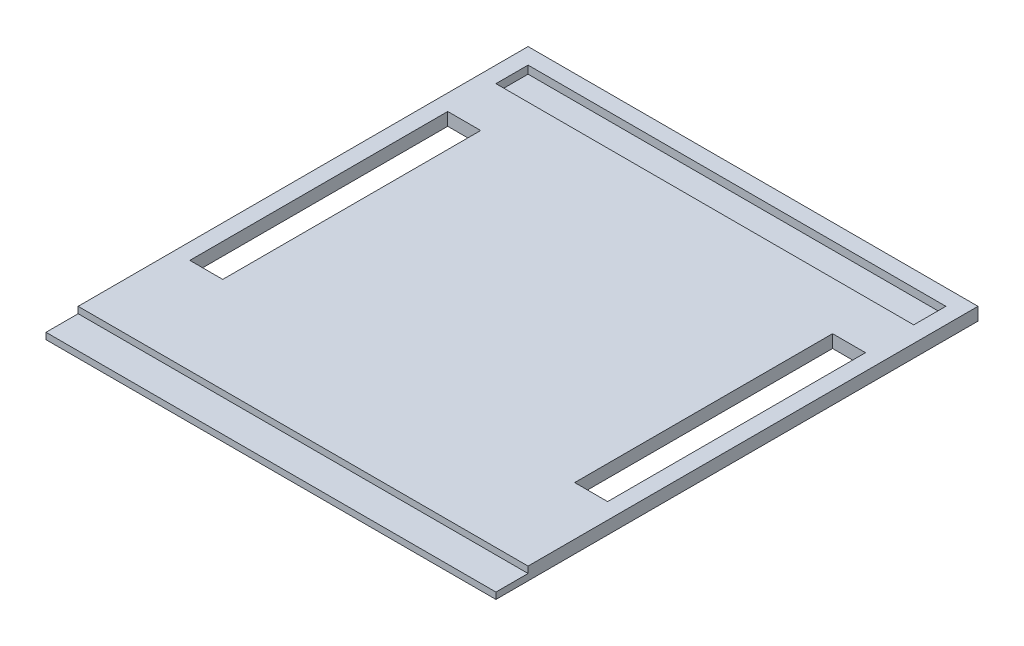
from build123d import *

# Parameters (mm, degrees)
SKETCH2_W               = 140
SKETCH2_H               = 420
BOSS_EXTRUDE1_DEPTH     = 4
BOSS_EXTRUDE2_DEPTH     = 25
SKETCH4_W               = 10.25
SKETCH4_H               = 80.25
CUT_EXTRUDE1_DEPTH      = 25.4
SKETCH7_W               = 130
SKETCH7_H               = 10
CUT_EXTRUDE2_DEPTH      = 2.45
CUT_EXTRUDE3_DEPTH      = 224.250979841
CUT_EXTRUDE3_DEPTH_BACK = 224.250979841
SKETCH9_W               = 140
SKETCH9_H               = 140
SKETCH10_W              = 140
SKETCH10_H              = 10
BOSS_EXTRUDE3_DEPTH     = 2


with BuildPart() as part:
    # Sketch2 → Boss-Extrude1 (new body)
    with BuildSketch(Plane(origin=(0, 0, 0), x_dir=(1, 0, 0), z_dir=(0, 1, 0))):
        Rectangle(SKETCH2_W, SKETCH2_H)
    extrude(amount=BOSS_EXTRUDE1_DEPTH)

    # Sketch3 → Boss-Extrude2 (add)
    with BuildSketch(Plane(origin=(0, 4, 0), x_dir=(1, 0, 0), z_dir=(0, 1, 0))):
        with BuildLine():
            Line((-37.5, -165), (-37.5, -145))
            Line((-37.5, -145), (-43.5, -145))
            Line((-43.5, -145), (-43.5, -165))
            ThreePointArc((-43.5, -165), (0, -208.5), (43.5, -165))
            Line((43.5, -165), (43.5, -145))
            Line((43.5, -145), (37.5, -145))
            Line((37.5, -145), (37.5, -165))
            ThreePointArc((37.5, -165), (0, -202.5), (-37.5, -165))
        make_face()
    extrude(amount=BOSS_EXTRUDE2_DEPTH)

    # Sketch4 → Cut-Extrude1 (cut)
    with BuildSketch(Plane(origin=(0, 4, 0), x_dir=(1, 0, 0), z_dir=(0, 1, 0))):
        with Locations((-59.875, 139.875)):
            Rectangle(SKETCH4_W, SKETCH4_H)
        with Locations((59.875, 139.875)):
            Rectangle(SKETCH4_W, SKETCH4_H)
    extrude(amount=-CUT_EXTRUDE1_DEPTH, mode=Mode.SUBTRACT)

    # Sketch7 → Cut-Extrude2 (cut)
    with BuildSketch(Plane(origin=(0, 4, 0), x_dir=(1, 0, 0), z_dir=(0, 1, 0))):
        with Locations((0, 200)):
            Rectangle(SKETCH7_W, SKETCH7_H)
    extrude(amount=-CUT_EXTRUDE2_DEPTH, mode=Mode.SUBTRACT)

    # Sketch9 → Cut-Extrude3 (cut, two sides: drawn at the far end of the back side and taken through both)
    with BuildSketch(Plane.XZ.offset(-CUT_EXTRUDE3_DEPTH_BACK)):
        Rectangle(SKETCH9_W, SKETCH9_H)
        with Locations((0, 140)):
            Rectangle(SKETCH9_W, SKETCH9_H)
    extrude(amount=CUT_EXTRUDE3_DEPTH + CUT_EXTRUDE3_DEPTH_BACK, mode=Mode.SUBTRACT)

    # Sketch10 → Boss-Extrude3 (add)
    with BuildSketch(Plane(origin=(0, 0, 0), x_dir=(1, 0, 0), z_dir=(0, 1, 0))):
        with Locations((0, 65)):
            Rectangle(SKETCH10_W, SKETCH10_H)
    extrude(amount=BOSS_EXTRUDE3_DEPTH)


solid = part.part
